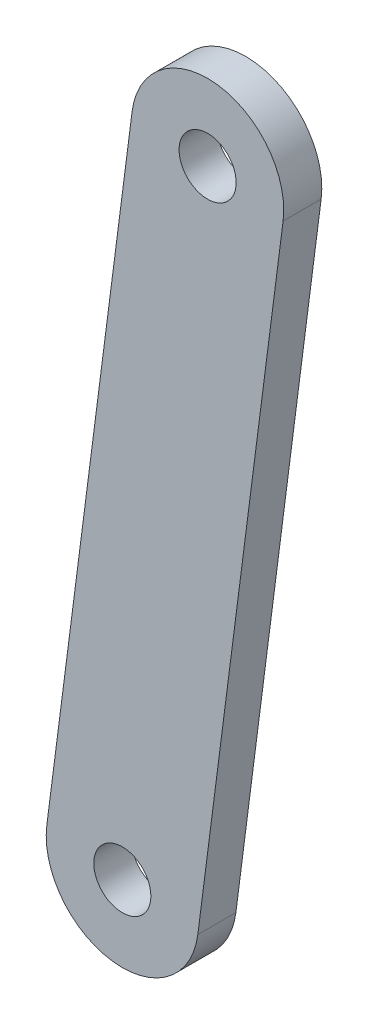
ISO-10303-21;
HEADER;
FILE_DESCRIPTION(('STEP AP214'),'2;1');
FILE_NAME('part.step','',(''),(''),'','','');
FILE_SCHEMA(('AUTOMOTIVE_DESIGN { 1 0 10303 214 1 1 1 1 }'));
ENDSEC;
DATA;
#1=APPLICATION_CONTEXT('core data for automotive mechanical design processes');
#2=APPLICATION_PROTOCOL_DEFINITION('international standard','automotive_design',2000,#1);
#3=PRODUCT_CONTEXT('',#1,'mechanical');
#4=PRODUCT('Part','Part','',(#3));
#5=PRODUCT_RELATED_PRODUCT_CATEGORY('part','',(#4));
#6=PRODUCT_DEFINITION_FORMATION('','',#4);
#7=PRODUCT_DEFINITION_CONTEXT('part definition',#1,'design');
#8=PRODUCT_DEFINITION('design','',#6,#7);
#9=PRODUCT_DEFINITION_SHAPE('','',#8);
#10=(LENGTH_UNIT() NAMED_UNIT(*) SI_UNIT(.MILLI.,.METRE.));
#11=(NAMED_UNIT(*) PLANE_ANGLE_UNIT() SI_UNIT($,.RADIAN.));
#12=(NAMED_UNIT(*) SI_UNIT($,.STERADIAN.) SOLID_ANGLE_UNIT());
#13=UNCERTAINTY_MEASURE_WITH_UNIT(LENGTH_MEASURE(1.E-05),#10,'distance_accuracy_value','');
#14=(GEOMETRIC_REPRESENTATION_CONTEXT(3) GLOBAL_UNCERTAINTY_ASSIGNED_CONTEXT((#13)) GLOBAL_UNIT_ASSIGNED_CONTEXT((#10,
#11,#12)) REPRESENTATION_CONTEXT('',''));
#15=CARTESIAN_POINT('',(0.,0.,0.));
#16=DIRECTION('',(0.,0.,1.));
#17=DIRECTION('',(1.,0.,0.));
#18=AXIS2_PLACEMENT_3D('',#15,#16,#17);
#19=CARTESIAN_POINT('',(434.859737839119,220.437946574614,6.35));
#20=DIRECTION('',(0.,0.,1.));
#21=DIRECTION('',(1.,0.,0.));
#22=AXIS2_PLACEMENT_3D('',#19,#20,#21);
#23=PLANE('',#22);
#24=CARTESIAN_POINT('',(434.859737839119,220.437946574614,6.35));
#25=DIRECTION('',(0.,0.,1.));
#26=DIRECTION('',(1.,0.,0.));
#27=AXIS2_PLACEMENT_3D('',#24,#25,#26);
#28=CIRCLE('',#27,9.52500000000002);
#29=CARTESIAN_POINT('',(444.384737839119,220.437946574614,6.35));
#30=VERTEX_POINT('',#29);
#31=EDGE_CURVE('E106',#30,#30,#28,.T.);
#32=ORIENTED_EDGE('',*,*,#31,.F.);
#33=EDGE_LOOP('',(#32));
#34=FACE_BOUND('',#33,.T.);
#35=CARTESIAN_POINT('',(434.859737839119,220.437946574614,6.35));
#36=DIRECTION('',(0.,0.,1.));
#37=DIRECTION('',(1.,0.,0.));
#38=AXIS2_PLACEMENT_3D('',#35,#36,#37);
#39=CIRCLE('',#38,25.4);
#40=CARTESIAN_POINT('',(460.050661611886,217.185661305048,6.35));
#41=VERTEX_POINT('',#40);
#42=CARTESIAN_POINT('',(409.668814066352,223.690231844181,6.35));
#43=VERTEX_POINT('',#42);
#44=EDGE_CURVE('E93',#41,#43,#39,.T.);
#45=ORIENTED_EDGE('',*,*,#44,.T.);
#46=DIRECTION('',(-0.128042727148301,-0.991768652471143,0.));
#47=VECTOR('',#46,1.);
#48=CARTESIAN_POINT('',(409.668814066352,223.690231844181,6.35));
#49=LINE('',#48,#47);
#50=CARTESIAN_POINT('',(381.209076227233,3.25228526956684,6.35));
#51=VERTEX_POINT('',#50);
#52=EDGE_CURVE('E88',#43,#51,#49,.T.);
#53=ORIENTED_EDGE('',*,*,#52,.T.);
#54=CARTESIAN_POINT('',(406.4,0.,6.35));
#55=DIRECTION('',(0.,0.,1.));
#56=DIRECTION('',(1.,0.,0.));
#57=AXIS2_PLACEMENT_3D('',#54,#55,#56);
#58=CIRCLE('',#57,25.4);
#59=CARTESIAN_POINT('',(431.590923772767,-3.25228526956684,6.35));
#60=VERTEX_POINT('',#59);
#61=EDGE_CURVE('E90',#51,#60,#58,.T.);
#62=ORIENTED_EDGE('',*,*,#61,.T.);
#63=DIRECTION('',(0.128042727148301,0.991768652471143,0.));
#64=VECTOR('',#63,1.);
#65=CARTESIAN_POINT('',(460.050661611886,217.185661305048,6.35));
#66=LINE('',#65,#64);
#67=EDGE_CURVE('E57',#60,#41,#66,.T.);
#68=ORIENTED_EDGE('',*,*,#67,.T.);
#69=EDGE_LOOP('',(#45,#53,#62,#68));
#70=FACE_BOUND('',#69,.T.);
#71=CARTESIAN_POINT('',(406.4,0.,6.35));
#72=DIRECTION('',(0.,0.,1.));
#73=DIRECTION('',(1.,0.,0.));
#74=AXIS2_PLACEMENT_3D('',#71,#72,#73);
#75=CIRCLE('',#74,9.52499999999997);
#76=CARTESIAN_POINT('',(415.925,0.,6.35));
#77=VERTEX_POINT('',#76);
#78=EDGE_CURVE('E123',#77,#77,#75,.T.);
#79=ORIENTED_EDGE('',*,*,#78,.F.);
#80=EDGE_LOOP('',(#79));
#81=FACE_BOUND('',#80,.T.);
#82=ADVANCED_FACE('F39',(#34,#70,#81),#23,.T.);
#83=CARTESIAN_POINT('',(434.859737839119,220.437946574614,-6.35));
#84=DIRECTION('',(0.,0.,1.));
#85=DIRECTION('',(1.,0.,0.));
#86=AXIS2_PLACEMENT_3D('',#83,#84,#85);
#87=PLANE('',#86);
#88=CARTESIAN_POINT('',(434.859737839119,220.437946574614,-6.35));
#89=DIRECTION('',(0.,0.,1.));
#90=DIRECTION('',(1.,0.,0.));
#91=AXIS2_PLACEMENT_3D('',#88,#89,#90);
#92=CIRCLE('',#91,25.4);
#93=CARTESIAN_POINT('',(460.050661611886,217.185661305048,-6.35));
#94=VERTEX_POINT('',#93);
#95=CARTESIAN_POINT('',(409.668814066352,223.690231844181,-6.35));
#96=VERTEX_POINT('',#95);
#97=EDGE_CURVE('E103',#94,#96,#92,.T.);
#98=ORIENTED_EDGE('',*,*,#97,.F.);
#99=DIRECTION('',(0.128042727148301,0.991768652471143,0.));
#100=VECTOR('',#99,1.);
#101=CARTESIAN_POINT('',(460.050661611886,217.185661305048,-6.35));
#102=LINE('',#101,#100);
#103=CARTESIAN_POINT('',(431.590923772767,-3.25228526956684,-6.35));
#104=VERTEX_POINT('',#103);
#105=EDGE_CURVE('E76',#104,#94,#102,.T.);
#106=ORIENTED_EDGE('',*,*,#105,.F.);
#107=CARTESIAN_POINT('',(406.4,0.,-6.35));
#108=DIRECTION('',(0.,0.,1.));
#109=DIRECTION('',(1.,0.,0.));
#110=AXIS2_PLACEMENT_3D('',#107,#108,#109);
#111=CIRCLE('',#110,25.4);
#112=CARTESIAN_POINT('',(381.209076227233,3.25228526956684,-6.35));
#113=VERTEX_POINT('',#112);
#114=EDGE_CURVE('E71',#113,#104,#111,.T.);
#115=ORIENTED_EDGE('',*,*,#114,.F.);
#116=DIRECTION('',(-0.128042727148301,-0.991768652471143,0.));
#117=VECTOR('',#116,1.);
#118=CARTESIAN_POINT('',(409.668814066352,223.690231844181,-6.35));
#119=LINE('',#118,#117);
#120=EDGE_CURVE('E92',#96,#113,#119,.T.);
#121=ORIENTED_EDGE('',*,*,#120,.F.);
#122=EDGE_LOOP('',(#98,#106,#115,#121));
#123=FACE_BOUND('',#122,.T.);
#124=CARTESIAN_POINT('',(434.859737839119,220.437946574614,-6.35));
#125=DIRECTION('',(0.,0.,1.));
#126=DIRECTION('',(1.,0.,0.));
#127=AXIS2_PLACEMENT_3D('',#124,#125,#126);
#128=CIRCLE('',#127,9.52500000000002);
#129=CARTESIAN_POINT('',(444.384737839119,220.437946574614,-6.35));
#130=VERTEX_POINT('',#129);
#131=EDGE_CURVE('E119',#130,#130,#128,.T.);
#132=ORIENTED_EDGE('',*,*,#131,.T.);
#133=EDGE_LOOP('',(#132));
#134=FACE_BOUND('',#133,.T.);
#135=CARTESIAN_POINT('',(406.4,0.,-6.35));
#136=DIRECTION('',(0.,0.,1.));
#137=DIRECTION('',(1.,0.,0.));
#138=AXIS2_PLACEMENT_3D('',#135,#136,#137);
#139=CIRCLE('',#138,9.52499999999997);
#140=CARTESIAN_POINT('',(415.925,0.,-6.35));
#141=VERTEX_POINT('',#140);
#142=EDGE_CURVE('E124',#141,#141,#139,.T.);
#143=ORIENTED_EDGE('',*,*,#142,.T.);
#144=EDGE_LOOP('',(#143));
#145=FACE_BOUND('',#144,.T.);
#146=ADVANCED_FACE('F111',(#123,#134,#145),#87,.F.);
#147=CARTESIAN_POINT('',(434.859737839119,220.437946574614,6.35));
#148=DIRECTION('',(0.,0.,-1.));
#149=DIRECTION('',(-1.,0.,0.));
#150=AXIS2_PLACEMENT_3D('',#147,#148,#149);
#151=CYLINDRICAL_SURFACE('',#150,25.4);
#152=ORIENTED_EDGE('',*,*,#97,.T.);
#153=DIRECTION('',(0.,0.,-1.));
#154=VECTOR('',#153,1.);
#155=CARTESIAN_POINT('',(409.668814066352,223.690231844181,6.35));
#156=LINE('',#155,#154);
#157=EDGE_CURVE('E11',#43,#96,#156,.T.);
#158=ORIENTED_EDGE('',*,*,#157,.F.);
#159=ORIENTED_EDGE('',*,*,#44,.F.);
#160=DIRECTION('',(0.,0.,-1.));
#161=VECTOR('',#160,1.);
#162=CARTESIAN_POINT('',(460.050661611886,217.185661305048,6.35));
#163=LINE('',#162,#161);
#164=EDGE_CURVE('E97',#41,#94,#163,.T.);
#165=ORIENTED_EDGE('',*,*,#164,.T.);
#166=EDGE_LOOP('',(#152,#158,#159,#165));
#167=FACE_BOUND('',#166,.T.);
#168=ADVANCED_FACE('F41',(#167),#151,.T.);
#169=CARTESIAN_POINT('',(409.668814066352,223.690231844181,6.35));
#170=DIRECTION('',(0.991768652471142,-0.128042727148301,0.));
#171=DIRECTION('',(0.128042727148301,0.991768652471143,0.));
#172=AXIS2_PLACEMENT_3D('',#169,#170,#171);
#173=PLANE('',#172);
#174=ORIENTED_EDGE('',*,*,#120,.T.);
#175=DIRECTION('',(0.,0.,-1.));
#176=VECTOR('',#175,1.);
#177=CARTESIAN_POINT('',(381.209076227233,3.25228526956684,6.35));
#178=LINE('',#177,#176);
#179=EDGE_CURVE('E48',#51,#113,#178,.T.);
#180=ORIENTED_EDGE('',*,*,#179,.F.);
#181=ORIENTED_EDGE('',*,*,#52,.F.);
#182=ORIENTED_EDGE('',*,*,#157,.T.);
#183=EDGE_LOOP('',(#174,#180,#181,#182));
#184=FACE_BOUND('',#183,.T.);
#185=ADVANCED_FACE('F94',(#184),#173,.F.);
#186=CARTESIAN_POINT('',(406.4,0.,6.35));
#187=DIRECTION('',(0.,0.,-1.));
#188=DIRECTION('',(-1.,0.,0.));
#189=AXIS2_PLACEMENT_3D('',#186,#187,#188);
#190=CYLINDRICAL_SURFACE('',#189,25.4);
#191=ORIENTED_EDGE('',*,*,#114,.T.);
#192=DIRECTION('',(0.,0.,-1.));
#193=VECTOR('',#192,1.);
#194=CARTESIAN_POINT('',(431.590923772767,-3.25228526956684,6.35));
#195=LINE('',#194,#193);
#196=EDGE_CURVE('E96',#60,#104,#195,.T.);
#197=ORIENTED_EDGE('',*,*,#196,.F.);
#198=ORIENTED_EDGE('',*,*,#61,.F.);
#199=ORIENTED_EDGE('',*,*,#179,.T.);
#200=EDGE_LOOP('',(#191,#197,#198,#199));
#201=FACE_BOUND('',#200,.T.);
#202=ADVANCED_FACE('F100',(#201),#190,.T.);
#203=CARTESIAN_POINT('',(460.050661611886,217.185661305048,6.35));
#204=DIRECTION('',(-0.991768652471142,0.128042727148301,0.));
#205=DIRECTION('',(-0.128042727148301,-0.991768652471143,0.));
#206=AXIS2_PLACEMENT_3D('',#203,#204,#205);
#207=PLANE('',#206);
#208=ORIENTED_EDGE('',*,*,#105,.T.);
#209=ORIENTED_EDGE('',*,*,#164,.F.);
#210=ORIENTED_EDGE('',*,*,#67,.F.);
#211=ORIENTED_EDGE('',*,*,#196,.T.);
#212=EDGE_LOOP('',(#208,#209,#210,#211));
#213=FACE_BOUND('',#212,.T.);
#214=ADVANCED_FACE('F112',(#213),#207,.F.);
#215=CARTESIAN_POINT('',(434.859737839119,220.437946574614,6.35));
#216=DIRECTION('',(0.,0.,-1.));
#217=DIRECTION('',(-1.,0.,0.));
#218=AXIS2_PLACEMENT_3D('',#215,#216,#217);
#219=CYLINDRICAL_SURFACE('',#218,9.52500000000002);
#220=ORIENTED_EDGE('',*,*,#31,.T.);
#221=EDGE_LOOP('',(#220));
#222=FACE_BOUND('',#221,.T.);
#223=ORIENTED_EDGE('',*,*,#131,.F.);
#224=EDGE_LOOP('',(#223));
#225=FACE_BOUND('',#224,.T.);
#226=ADVANCED_FACE('F142',(#222,#225),#219,.F.);
#227=CARTESIAN_POINT('',(406.4,0.,6.35));
#228=DIRECTION('',(0.,0.,-1.));
#229=DIRECTION('',(-1.,0.,0.));
#230=AXIS2_PLACEMENT_3D('',#227,#228,#229);
#231=CYLINDRICAL_SURFACE('',#230,9.52499999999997);
#232=ORIENTED_EDGE('',*,*,#78,.T.);
#233=EDGE_LOOP('',(#232));
#234=FACE_BOUND('',#233,.T.);
#235=ORIENTED_EDGE('',*,*,#142,.F.);
#236=EDGE_LOOP('',(#235));
#237=FACE_BOUND('',#236,.T.);
#238=ADVANCED_FACE('F128',(#234,#237),#231,.F.);
#239=CLOSED_SHELL('',(#82,#146,#168,#185,#202,#214,#226,#238));
#240=MANIFOLD_SOLID_BREP('B2',#239);
#241=ADVANCED_BREP_SHAPE_REPRESENTATION('',(#18,#240),#14);
#242=SHAPE_DEFINITION_REPRESENTATION(#9,#241);
ENDSEC;
END-ISO-10303-21;
